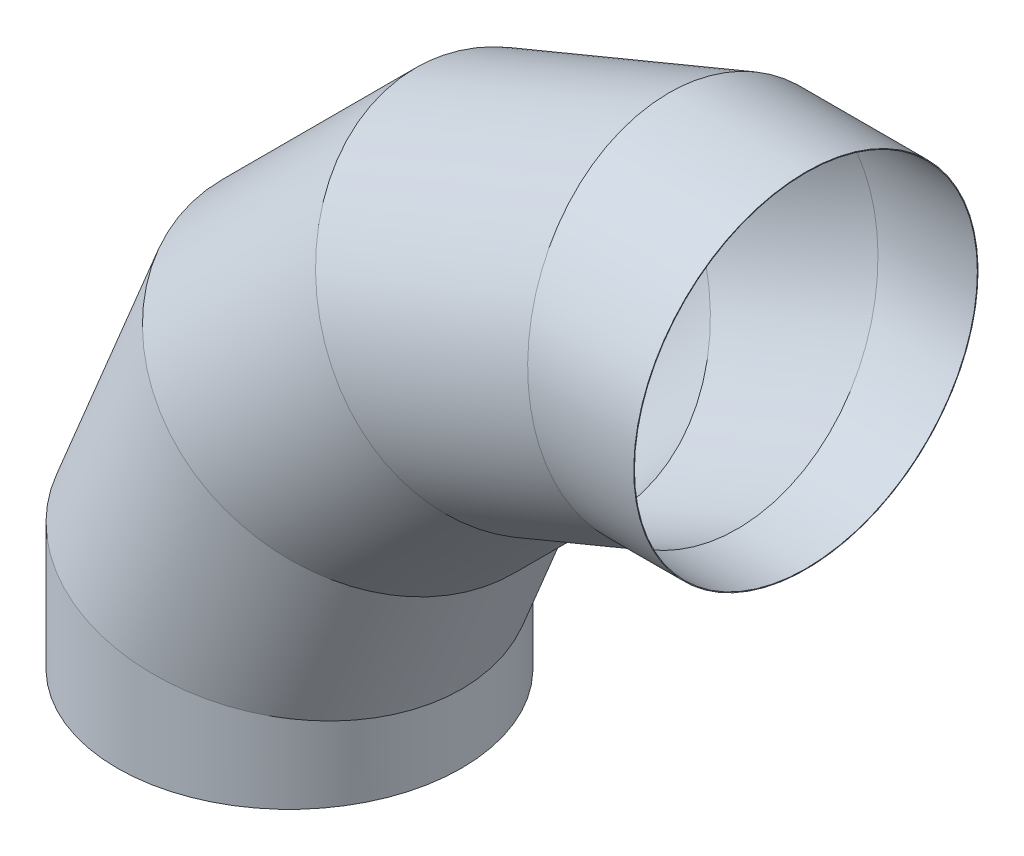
ISO-10303-21;
HEADER;
FILE_DESCRIPTION(('STEP AP214'),'2;1');
FILE_NAME('part.step','',(''),(''),'','','');
FILE_SCHEMA(('AUTOMOTIVE_DESIGN { 1 0 10303 214 1 1 1 1 }'));
ENDSEC;
DATA;
#1=APPLICATION_CONTEXT('core data for automotive mechanical design processes');
#2=APPLICATION_PROTOCOL_DEFINITION('international standard','automotive_design',2000,#1);
#3=PRODUCT_CONTEXT('',#1,'mechanical');
#4=PRODUCT('Part','Part','',(#3));
#5=PRODUCT_RELATED_PRODUCT_CATEGORY('part','',(#4));
#6=PRODUCT_DEFINITION_FORMATION('','',#4);
#7=PRODUCT_DEFINITION_CONTEXT('part definition',#1,'design');
#8=PRODUCT_DEFINITION('design','',#6,#7);
#9=PRODUCT_DEFINITION_SHAPE('','',#8);
#10=(LENGTH_UNIT() NAMED_UNIT(*) SI_UNIT(.MILLI.,.METRE.));
#11=(NAMED_UNIT(*) PLANE_ANGLE_UNIT() SI_UNIT($,.RADIAN.));
#12=(NAMED_UNIT(*) SI_UNIT($,.STERADIAN.) SOLID_ANGLE_UNIT());
#13=UNCERTAINTY_MEASURE_WITH_UNIT(LENGTH_MEASURE(1.E-05),#10,'distance_accuracy_value','');
#14=(GEOMETRIC_REPRESENTATION_CONTEXT(3) GLOBAL_UNCERTAINTY_ASSIGNED_CONTEXT((#13)) GLOBAL_UNIT_ASSIGNED_CONTEXT((#10,
#11,#12)) REPRESENTATION_CONTEXT('',''));
#15=CARTESIAN_POINT('',(0.,0.,0.));
#16=DIRECTION('',(0.,0.,1.));
#17=DIRECTION('',(1.,0.,0.));
#18=AXIS2_PLACEMENT_3D('',#15,#16,#17);
#19=CARTESIAN_POINT('',(-298.368551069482,1500.,0.));
#20=DIRECTION('',(1.,0.,0.));
#21=DIRECTION('',(0.,1.,0.));
#22=AXIS2_PLACEMENT_3D('',#19,#20,#21);
#23=CYLINDRICAL_SURFACE('',#22,500.);
#24=CARTESIAN_POINT('',(-298.368551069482,1500.,0.));
#25=DIRECTION('',(0.980785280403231,0.195090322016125,0.));
#26=DIRECTION('',(-0.195090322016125,0.980785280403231,0.));
#27=AXIS2_PLACEMENT_3D('',#24,#25,#26);
#28=ELLIPSE('',#27,509.795579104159,500.);
#29=CARTESIAN_POINT('',(-397.82473475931,2000.,0.));
#30=VERTEX_POINT('',#29);
#31=EDGE_CURVE('E40',#30,#30,#28,.F.);
#32=ORIENTED_EDGE('',*,*,#31,.F.);
#33=EDGE_LOOP('',(#32));
#34=FACE_BOUND('',#33,.T.);
#35=CARTESIAN_POINT('',(5.32907051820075E-12,1500.,0.));
#36=DIRECTION('',(1.,0.,0.));
#37=DIRECTION('',(0.,1.,0.));
#38=AXIS2_PLACEMENT_3D('',#35,#36,#37);
#39=CIRCLE('',#38,500.);
#40=CARTESIAN_POINT('',(7.1895598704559E-12,2000.,0.));
#41=VERTEX_POINT('',#40);
#42=EDGE_CURVE('E11',#41,#41,#39,.T.);
#43=ORIENTED_EDGE('',*,*,#42,.F.);
#44=EDGE_LOOP('',(#43));
#45=FACE_BOUND('',#44,.T.);
#46=ADVANCED_FACE('F34',(#34,#45),#23,.T.);
#47=CARTESIAN_POINT('',(-849.681746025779,1271.63859753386,0.));
#48=DIRECTION('',(0.923879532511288,0.382683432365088,0.));
#49=DIRECTION('',(-0.382683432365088,0.923879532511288,0.));
#50=AXIS2_PLACEMENT_3D('',#47,#48,#49);
#51=CYLINDRICAL_SURFACE('',#50,500.);
#52=CARTESIAN_POINT('',(-849.681746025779,1271.63859753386,0.));
#53=DIRECTION('',(0.831469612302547,0.5555702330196,0.));
#54=DIRECTION('',(-0.5555702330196,0.831469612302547,0.));
#55=AXIS2_PLACEMENT_3D('',#52,#53,#54);
#56=ELLIPSE('',#55,509.795579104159,500.);
#57=CARTESIAN_POINT('',(-1132.90899470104,1695.51813004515,0.));
#58=VERTEX_POINT('',#57);
#59=EDGE_CURVE('E44',#58,#58,#56,.T.);
#60=ORIENTED_EDGE('',*,*,#59,.T.);
#61=EDGE_LOOP('',(#60));
#62=FACE_BOUND('',#61,.T.);
#63=ORIENTED_EDGE('',*,*,#31,.T.);
#64=EDGE_LOOP('',(#63));
#65=FACE_BOUND('',#64,.T.);
#66=ADVANCED_FACE('F97',(#62,#65),#51,.T.);
#67=CARTESIAN_POINT('',(-1271.63859753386,849.681746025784,0.));
#68=DIRECTION('',(0.70710678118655,0.707106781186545,0.));
#69=DIRECTION('',(-0.707106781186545,0.70710678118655,0.));
#70=AXIS2_PLACEMENT_3D('',#67,#68,#69);
#71=CYLINDRICAL_SURFACE('',#70,500.);
#72=CARTESIAN_POINT('',(-1271.63859753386,849.681746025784,0.));
#73=DIRECTION('',(0.555570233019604,0.831469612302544,0.));
#74=DIRECTION('',(-0.831469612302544,0.555570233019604,0.));
#75=AXIS2_PLACEMENT_3D('',#72,#73,#74);
#76=ELLIPSE('',#75,509.79557910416,500.);
#77=CARTESIAN_POINT('',(-1695.51813004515,1132.90899470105,0.));
#78=VERTEX_POINT('',#77);
#79=EDGE_CURVE('E48',#78,#78,#76,.F.);
#80=ORIENTED_EDGE('',*,*,#79,.F.);
#81=EDGE_LOOP('',(#80));
#82=FACE_BOUND('',#81,.T.);
#83=ORIENTED_EDGE('',*,*,#59,.F.);
#84=EDGE_LOOP('',(#83));
#85=FACE_BOUND('',#84,.T.);
#86=ADVANCED_FACE('F102',(#82,#85),#71,.T.);
#87=CARTESIAN_POINT('',(-1500.,298.368551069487,0.));
#88=DIRECTION('',(0.382683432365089,0.923879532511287,0.));
#89=DIRECTION('',(-0.923879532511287,0.382683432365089,0.));
#90=AXIS2_PLACEMENT_3D('',#87,#88,#89);
#91=CYLINDRICAL_SURFACE('',#90,500.);
#92=CARTESIAN_POINT('',(-1500.,298.368551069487,0.));
#93=DIRECTION('',(0.195090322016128,0.980785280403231,0.));
#94=DIRECTION('',(0.980785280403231,-0.195090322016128,0.));
#95=AXIS2_PLACEMENT_3D('',#92,#93,#94);
#96=ELLIPSE('',#95,509.795579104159,500.);
#97=CARTESIAN_POINT('',(-1000.,198.912367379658,0.));
#98=VERTEX_POINT('',#97);
#99=EDGE_CURVE('E53',#98,#98,#96,.T.);
#100=ORIENTED_EDGE('',*,*,#99,.T.);
#101=EDGE_LOOP('',(#100));
#102=FACE_BOUND('',#101,.T.);
#103=ORIENTED_EDGE('',*,*,#79,.T.);
#104=EDGE_LOOP('',(#103));
#105=FACE_BOUND('',#104,.T.);
#106=ADVANCED_FACE('F108',(#102,#105),#91,.T.);
#107=CARTESIAN_POINT('',(-1500.,1712.58211344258,0.));
#108=DIRECTION('',(0.,-1.,0.));
#109=DIRECTION('',(1.,0.,0.));
#110=AXIS2_PLACEMENT_3D('',#107,#108,#109);
#111=CYLINDRICAL_SURFACE('',#110,500.);
#112=CARTESIAN_POINT('',(-1500.,0.,0.));
#113=DIRECTION('',(0.,1.,0.));
#114=DIRECTION('',(0.,0.,1.));
#115=AXIS2_PLACEMENT_3D('',#112,#113,#114);
#116=CIRCLE('',#115,500.);
#117=CARTESIAN_POINT('',(-1500.,0.,500.));
#118=VERTEX_POINT('',#117);
#119=EDGE_CURVE('E56',#118,#118,#116,.T.);
#120=ORIENTED_EDGE('',*,*,#119,.T.);
#121=EDGE_LOOP('',(#120));
#122=FACE_BOUND('',#121,.T.);
#123=ORIENTED_EDGE('',*,*,#99,.F.);
#124=EDGE_LOOP('',(#123));
#125=FACE_BOUND('',#124,.T.);
#126=ADVANCED_FACE('F114',(#122,#125),#111,.T.);
#127=CARTESIAN_POINT('',(-1500.,0.,0.));
#128=DIRECTION('',(0.,1.,0.));
#129=DIRECTION('',(0.,0.,1.));
#130=AXIS2_PLACEMENT_3D('',#127,#128,#129);
#131=PLANE('',#130);
#132=CARTESIAN_POINT('',(-1500.,0.,0.));
#133=DIRECTION('',(0.,1.,0.));
#134=DIRECTION('',(0.,0.,1.));
#135=AXIS2_PLACEMENT_3D('',#132,#133,#134);
#136=CIRCLE('',#135,498.);
#137=CARTESIAN_POINT('',(-1500.,0.,498.));
#138=VERTEX_POINT('',#137);
#139=EDGE_CURVE('E60',#138,#138,#136,.T.);
#140=ORIENTED_EDGE('',*,*,#139,.T.);
#141=EDGE_LOOP('',(#140));
#142=FACE_BOUND('',#141,.T.);
#143=ORIENTED_EDGE('',*,*,#119,.F.);
#144=EDGE_LOOP('',(#143));
#145=FACE_BOUND('',#144,.T.);
#146=ADVANCED_FACE('F118',(#142,#145),#131,.F.);
#147=CARTESIAN_POINT('',(5.32907051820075E-12,1500.,0.));
#148=DIRECTION('',(1.,0.,0.));
#149=DIRECTION('',(0.,1.,0.));
#150=AXIS2_PLACEMENT_3D('',#147,#148,#149);
#151=PLANE('',#150);
#152=CARTESIAN_POINT('',(5.32907051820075E-12,1500.,0.));
#153=DIRECTION('',(1.,0.,0.));
#154=DIRECTION('',(0.,1.,0.));
#155=AXIS2_PLACEMENT_3D('',#152,#153,#154);
#156=CIRCLE('',#155,498.);
#157=CARTESIAN_POINT('',(7.18211791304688E-12,1998.,0.));
#158=VERTEX_POINT('',#157);
#159=EDGE_CURVE('E59',#158,#158,#156,.T.);
#160=ORIENTED_EDGE('',*,*,#159,.F.);
#161=EDGE_LOOP('',(#160));
#162=FACE_BOUND('',#161,.T.);
#163=ORIENTED_EDGE('',*,*,#42,.T.);
#164=EDGE_LOOP('',(#163));
#165=FACE_BOUND('',#164,.T.);
#166=ADVANCED_FACE('F93',(#162,#165),#151,.T.);
#167=CARTESIAN_POINT('',(-298.368551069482,1500.,0.));
#168=DIRECTION('',(1.,0.,0.));
#169=DIRECTION('',(0.,1.,0.));
#170=AXIS2_PLACEMENT_3D('',#167,#168,#169);
#171=CYLINDRICAL_SURFACE('',#170,498.);
#172=CARTESIAN_POINT('',(-298.368551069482,1500.,0.));
#173=DIRECTION('',(0.980785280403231,0.195090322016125,0.));
#174=DIRECTION('',(-0.195090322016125,0.980785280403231,0.));
#175=AXIS2_PLACEMENT_3D('',#172,#173,#174);
#176=ELLIPSE('',#175,507.756396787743,498.);
#177=CARTESIAN_POINT('',(-397.42691002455,1998.,0.));
#178=VERTEX_POINT('',#177);
#179=EDGE_CURVE('E66',#178,#178,#176,.F.);
#180=ORIENTED_EDGE('',*,*,#179,.T.);
#181=EDGE_LOOP('',(#180));
#182=FACE_BOUND('',#181,.T.);
#183=ORIENTED_EDGE('',*,*,#159,.T.);
#184=EDGE_LOOP('',(#183));
#185=FACE_BOUND('',#184,.T.);
#186=ADVANCED_FACE('F78',(#182,#185),#171,.F.);
#187=CARTESIAN_POINT('',(-849.681746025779,1271.63859753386,0.));
#188=DIRECTION('',(0.923879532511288,0.382683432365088,0.));
#189=DIRECTION('',(-0.382683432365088,0.923879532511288,0.));
#190=AXIS2_PLACEMENT_3D('',#187,#188,#189);
#191=CYLINDRICAL_SURFACE('',#190,498.);
#192=CARTESIAN_POINT('',(-849.681746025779,1271.63859753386,0.));
#193=DIRECTION('',(0.831469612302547,0.5555702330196,0.));
#194=DIRECTION('',(0.5555702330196,-0.831469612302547,0.));
#195=AXIS2_PLACEMENT_3D('',#192,#193,#194);
#196=ELLIPSE('',#195,507.756396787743,498.);
#197=CARTESIAN_POINT('',(-567.58740634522,849.45458315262,0.));
#198=VERTEX_POINT('',#197);
#199=EDGE_CURVE('E72',#198,#198,#196,.T.);
#200=ORIENTED_EDGE('',*,*,#199,.F.);
#201=EDGE_LOOP('',(#200));
#202=FACE_BOUND('',#201,.T.);
#203=ORIENTED_EDGE('',*,*,#179,.F.);
#204=EDGE_LOOP('',(#203));
#205=FACE_BOUND('',#204,.T.);
#206=ADVANCED_FACE('F81',(#202,#205),#191,.F.);
#207=CARTESIAN_POINT('',(-1271.63859753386,849.681746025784,0.));
#208=DIRECTION('',(0.70710678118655,0.707106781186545,0.));
#209=DIRECTION('',(-0.707106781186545,0.70710678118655,0.));
#210=AXIS2_PLACEMENT_3D('',#207,#208,#209);
#211=CYLINDRICAL_SURFACE('',#210,498.);
#212=CARTESIAN_POINT('',(-1271.63859753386,849.681746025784,0.));
#213=DIRECTION('',(0.555570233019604,0.831469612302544,0.));
#214=DIRECTION('',(-0.831469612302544,0.555570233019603,0.));
#215=AXIS2_PLACEMENT_3D('',#212,#213,#214);
#216=ELLIPSE('',#215,507.756396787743,498.);
#217=CARTESIAN_POINT('',(-1693.8226119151,1131.77608570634,0.));
#218=VERTEX_POINT('',#217);
#219=EDGE_CURVE('E69',#218,#218,#216,.F.);
#220=ORIENTED_EDGE('',*,*,#219,.T.);
#221=EDGE_LOOP('',(#220));
#222=FACE_BOUND('',#221,.T.);
#223=ORIENTED_EDGE('',*,*,#199,.T.);
#224=EDGE_LOOP('',(#223));
#225=FACE_BOUND('',#224,.T.);
#226=ADVANCED_FACE('F83',(#222,#225),#211,.F.);
#227=CARTESIAN_POINT('',(-1500.,298.368551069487,0.));
#228=DIRECTION('',(0.382683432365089,0.923879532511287,0.));
#229=DIRECTION('',(-0.923879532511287,0.382683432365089,0.));
#230=AXIS2_PLACEMENT_3D('',#227,#228,#229);
#231=CYLINDRICAL_SURFACE('',#230,498.);
#232=CARTESIAN_POINT('',(-1500.,298.368551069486,0.));
#233=DIRECTION('',(-0.195090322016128,-0.98078528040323,0.));
#234=DIRECTION('',(0.98078528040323,-0.195090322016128,0.));
#235=AXIS2_PLACEMENT_3D('',#232,#233,#234);
#236=ELLIPSE('',#235,507.756396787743,498.);
#237=CARTESIAN_POINT('',(-1002.,199.310192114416,0.));
#238=VERTEX_POINT('',#237);
#239=EDGE_CURVE('E63',#238,#238,#236,.F.);
#240=ORIENTED_EDGE('',*,*,#239,.F.);
#241=EDGE_LOOP('',(#240));
#242=FACE_BOUND('',#241,.T.);
#243=ORIENTED_EDGE('',*,*,#219,.F.);
#244=EDGE_LOOP('',(#243));
#245=FACE_BOUND('',#244,.T.);
#246=ADVANCED_FACE('F90',(#242,#245),#231,.F.);
#247=CARTESIAN_POINT('',(-1500.,1712.58211344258,0.));
#248=DIRECTION('',(0.,-1.,0.));
#249=DIRECTION('',(1.,0.,0.));
#250=AXIS2_PLACEMENT_3D('',#247,#248,#249);
#251=CYLINDRICAL_SURFACE('',#250,498.);
#252=ORIENTED_EDGE('',*,*,#139,.F.);
#253=EDGE_LOOP('',(#252));
#254=FACE_BOUND('',#253,.T.);
#255=ORIENTED_EDGE('',*,*,#239,.T.);
#256=EDGE_LOOP('',(#255));
#257=FACE_BOUND('',#256,.T.);
#258=ADVANCED_FACE('F126',(#254,#257),#251,.F.);
#259=CLOSED_SHELL('',(#46,#66,#86,#106,#126,#146,#166,#186,#206,#226,#246,#258));
#260=MANIFOLD_SOLID_BREP('B2',#259);
#261=ADVANCED_BREP_SHAPE_REPRESENTATION('',(#18,#260),#14);
#262=SHAPE_DEFINITION_REPRESENTATION(#9,#261);
ENDSEC;
END-ISO-10303-21;
